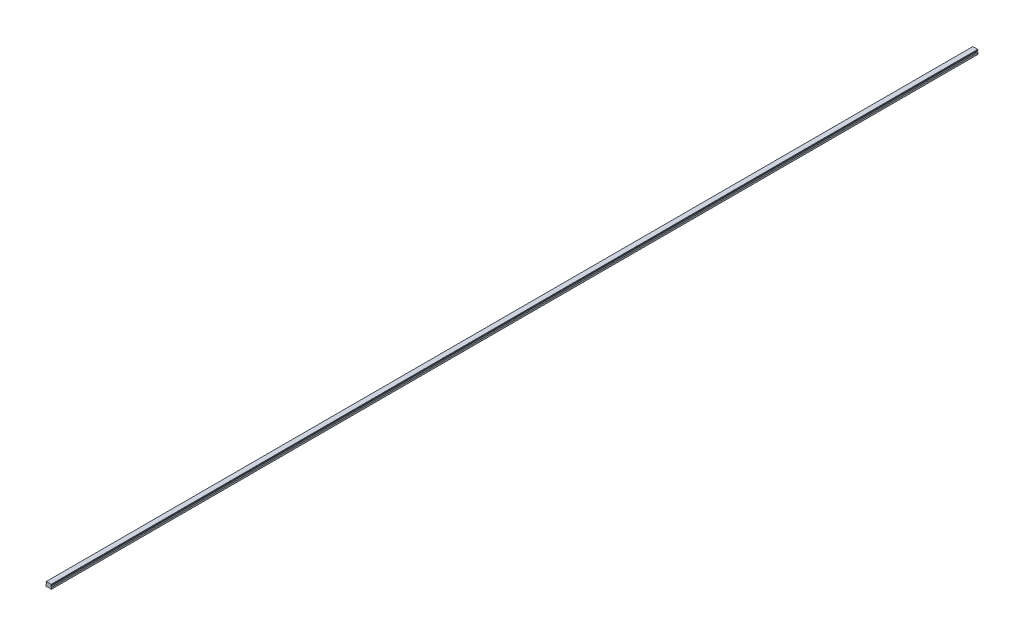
from build123d import *

# Parameters (mm, degrees)
SKETCH1_W           = 20
SKETCH1_H           = 16.3
BOSS_EXTRUDE1_DEPTH = 1700
CUT_EXTRUDE1_DEPTH  = 3401.053777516
CHAMFER1_SIZE       = 1
FILLET1_R           = 1
CUT_EXTRUDE2_DEPTH  = 3401.053777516
SKETCH5_R           = 3
SKETCH5_R_2         = 2.5
CUT_EXTRUDE5_DEPTH  = 10
SKETCH5_2_R         = 2.5
CUT_EXTRUDE6_DEPTH  = 13
LPATTERN2_COUNT     = 57
LPATTERN2_PITCH     = 60


with BuildPart() as part:
    # Sketch1 → Boss-Extrude1 (new, symmetric)
    with BuildSketch(Plane.XY):
        with Locations((0, 8.15)):
            Rectangle(SKETCH1_W, SKETCH1_H)
    extrude(amount=BOSS_EXTRUDE1_DEPTH, both=True)

    # Sketch2 → Cut-Extrude1 (cut, through all)
    with BuildSketch(Plane.XY.offset(1700)):
        Polygon((-10, 14.3), (-10, 7.3), (-7.666666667, 9.633333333), (-7.666666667, 11.966666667), align=None)
        Polygon((7.666666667, 11.966666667), (10, 14.3), (10, 7.3), (7.666666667, 9.633333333), align=None)
    extrude(amount=-CUT_EXTRUDE1_DEPTH, mode=Mode.SUBTRACT)

    # Chamfer1
    chamfer1_edges = [part.edges().sort_by_distance(p)[0] for p in [
        (-10, 16.3, 0),
        (10, 16.3, 0),
        (10, 0, 0),
        (-10, 0, 0),
    ]]
    chamfer(chamfer1_edges, length=CHAMFER1_SIZE)

    # Fillet1
    fillet1_edges = [part.edges().sort_by_distance(p)[0] for p in [
        (-7.666666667, 11.966666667, 0),
        (-7.666666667, 9.633333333, 0),
        (7.666666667, 9.633333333, 0),
        (7.666666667, 11.966666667, 0),
    ]]
    fillet(fillet1_edges, radius=FILLET1_R)

    # Sketch3 → Cut-Extrude2 (cut, through all)
    with BuildSketch(Plane.XY.offset(1700)):
        Polygon((-6, 0), (-5, 1), (5, 1), (6, 0), align=None)
    extrude(amount=-CUT_EXTRUDE2_DEPTH, mode=Mode.SUBTRACT)

    # Sketch5 → Cut-Extrude5 (cut)
    with BuildSketch(Plane.XZ.offset(-1)):
        with Locations(Location((0, 1680, 0), (0, 0, 270))):
            Circle(SKETCH5_R)
        with Locations(Location((0, 1680, 0), (0, 0, 270))):
            Circle(SKETCH5_R_2, mode=Mode.SUBTRACT)
    cut_extrude5 = extrude(amount=-CUT_EXTRUDE5_DEPTH, mode=Mode.SUBTRACT)

    # Sketch5_2 → Cut-Extrude6 (cut)
    with BuildSketch(Plane.XZ.offset(-1)):
        with Locations(Location((0, 1680, 0), (0, 0, 270))):
            Circle(SKETCH5_2_R)
    cut_extrude6 = extrude(amount=-CUT_EXTRUDE6_DEPTH, mode=Mode.SUBTRACT)

    # Cut-Extrude7 cone 1 section (on through the dimple's axis) → Cut-Extrude7 (revolve, cut)
    with BuildSketch(Plane(origin=(0, 14, 1680), x_dir=(0, 0, -1), z_dir=(1, 0, 0))):
        Polygon((0, 0), (2.5, 0), (0, 1.443375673), align=None)
    cut_extrude7 = revolve(axis=Axis((0, 14, 1680), (0, 1, 0)), mode=Mode.SUBTRACT)

    # LPattern2: Cut-Extrude5, Cut-Extrude6, Cut-Extrude7 ×57
    with Locations(*[(0, 0, -i * LPATTERN2_PITCH) for i in range(1, LPATTERN2_COUNT)]):
        add(cut_extrude5, mode=Mode.SUBTRACT)
        add(cut_extrude6, mode=Mode.SUBTRACT)
        add(cut_extrude7, mode=Mode.SUBTRACT)


solid = part.part
